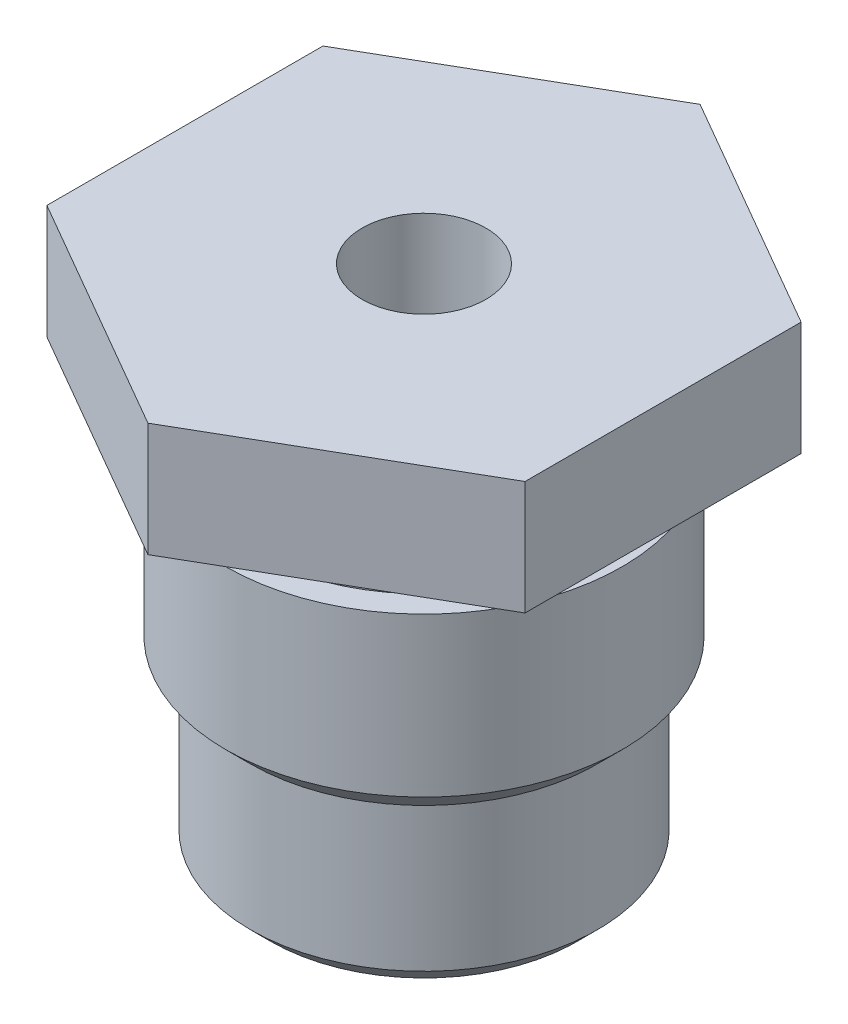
from build123d import *

# Parameters (mm, degrees)
ESQUISSE2_R        = 1.25
BOSS_EXTRU_1_DEPTH = 2.3


with BuildPart() as part:
    # Esquisse1 → Base-R_volution (revolve)
    with BuildSketch(Plane.XY, mode=Mode.PRIVATE) as base_r_volution_sk:
        Polygon((-2.6, 0), (-3.1, 0), (-3.5, 0.4), (-3.5, 3.3), (-4, 3.8), (-4, 7), (-3.5, 7), (-3.5, 8), (-1.25, 8), (-1.25, 6.5), (-2.6, 5.73), align=None)
    revolve(base_r_volution_sk.sketch.rotate(Axis((0, 60, 0), (0, -1, 0)), 270), axis=Axis((0, 60, 0), (0, -1, 0)))

    # Esquisse2 → Boss.-Extru.1 (add)
    with BuildSketch(Plane(origin=(0, 8, 0), x_dir=(-1, 0, 0), z_dir=(0, 1, 0))):
        Polygon((0, 5.575), (-4.828091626, 2.7875), (-4.828091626, -2.7875), (0, -5.575), (4.828091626, -2.7875), (4.828091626, 2.7875), align=None)
        with Locations(Location((0, 0, 0), (0, 0, 90))):
            Circle(ESQUISSE2_R, mode=Mode.SUBTRACT)
    extrude(amount=BOSS_EXTRU_1_DEPTH)


solid = part.part
